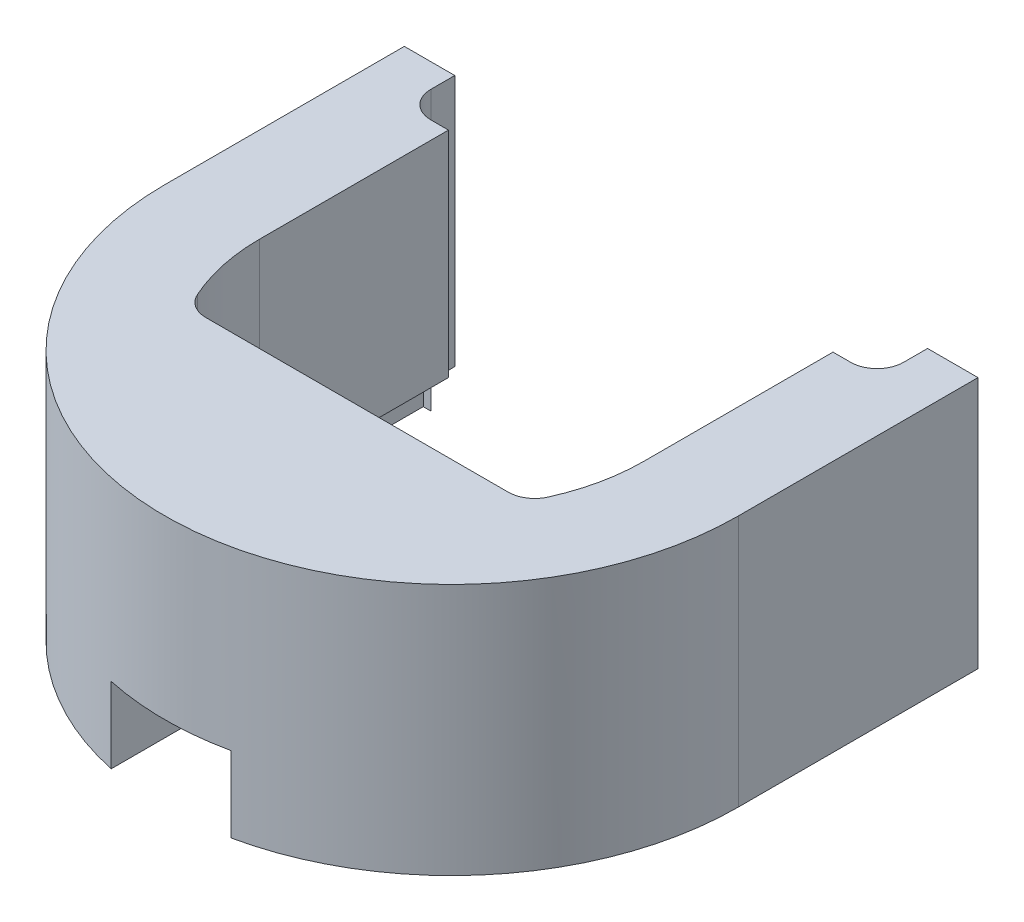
ISO-10303-21;
HEADER;
FILE_DESCRIPTION(('STEP AP214'),'2;1');
FILE_NAME('part.step','',(''),(''),'','','');
FILE_SCHEMA(('AUTOMOTIVE_DESIGN { 1 0 10303 214 1 1 1 1 }'));
ENDSEC;
DATA;
#1=APPLICATION_CONTEXT('core data for automotive mechanical design processes');
#2=APPLICATION_PROTOCOL_DEFINITION('international standard','automotive_design',2000,#1);
#3=PRODUCT_CONTEXT('',#1,'mechanical');
#4=PRODUCT('Part','Part','',(#3));
#5=PRODUCT_RELATED_PRODUCT_CATEGORY('part','',(#4));
#6=PRODUCT_DEFINITION_FORMATION('','',#4);
#7=PRODUCT_DEFINITION_CONTEXT('part definition',#1,'design');
#8=PRODUCT_DEFINITION('design','',#6,#7);
#9=PRODUCT_DEFINITION_SHAPE('','',#8);
#10=(LENGTH_UNIT() NAMED_UNIT(*) SI_UNIT(.MILLI.,.METRE.));
#11=(NAMED_UNIT(*) PLANE_ANGLE_UNIT() SI_UNIT($,.RADIAN.));
#12=(NAMED_UNIT(*) SI_UNIT($,.STERADIAN.) SOLID_ANGLE_UNIT());
#13=UNCERTAINTY_MEASURE_WITH_UNIT(LENGTH_MEASURE(1.E-05),#10,'distance_accuracy_value','');
#14=(GEOMETRIC_REPRESENTATION_CONTEXT(3) GLOBAL_UNCERTAINTY_ASSIGNED_CONTEXT((#13)) GLOBAL_UNIT_ASSIGNED_CONTEXT((#10,
#11,#12)) REPRESENTATION_CONTEXT('',''));
#15=CARTESIAN_POINT('',(0.,0.,0.));
#16=DIRECTION('',(0.,0.,1.));
#17=DIRECTION('',(1.,0.,0.));
#18=AXIS2_PLACEMENT_3D('',#15,#16,#17);
#19=CARTESIAN_POINT('',(23.9802001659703,0.,40.8));
#20=DIRECTION('',(0.,1.,0.));
#21=DIRECTION('',(0.,0.,1.));
#22=AXIS2_PLACEMENT_3D('',#19,#20,#21);
#23=PLANE('',#22);
#24=DIRECTION('',(-1.,0.,0.));
#25=VECTOR('',#24,1.);
#26=CARTESIAN_POINT('',(-18.7523331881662,0.,58.));
#27=LINE('',#26,#25);
#28=CARTESIAN_POINT('',(-9.5,0.,58.));
#29=VERTEX_POINT('',#28);
#30=CARTESIAN_POINT('',(-18.7523331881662,0.,58.));
#31=VERTEX_POINT('',#30);
#32=EDGE_CURVE('E347',#29,#31,#27,.T.);
#33=ORIENTED_EDGE('',*,*,#32,.F.);
#34=DIRECTION('',(0.,0.,-1.));
#35=VECTOR('',#34,1.);
#36=CARTESIAN_POINT('',(-9.5,0.,77.));
#37=LINE('',#36,#35);
#38=CARTESIAN_POINT('',(-9.5,0.,74.497190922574));
#39=VERTEX_POINT('',#38);
#40=EDGE_CURVE('E522',#39,#29,#37,.T.);
#41=ORIENTED_EDGE('',*,*,#40,.F.);
#42=CARTESIAN_POINT('',(0.,0.,30.));
#43=DIRECTION('',(0.,1.,0.));
#44=DIRECTION('',(0.,0.,1.));
#45=AXIS2_PLACEMENT_3D('',#42,#43,#44);
#46=CIRCLE('',#45,45.5);
#47=CARTESIAN_POINT('',(-45.5,0.,30.));
#48=VERTEX_POINT('',#47);
#49=EDGE_CURVE('E193',#48,#39,#46,.T.);
#50=ORIENTED_EDGE('',*,*,#49,.F.);
#51=DIRECTION('',(0.,0.,1.));
#52=VECTOR('',#51,1.);
#53=CARTESIAN_POINT('',(-45.5,0.,-8.));
#54=LINE('',#53,#52);
#55=CARTESIAN_POINT('',(-45.5,0.,-8.));
#56=VERTEX_POINT('',#55);
#57=EDGE_CURVE('E190',#56,#48,#54,.T.);
#58=ORIENTED_EDGE('',*,*,#57,.F.);
#59=DIRECTION('',(-1.,0.,0.));
#60=VECTOR('',#59,1.);
#61=CARTESIAN_POINT('',(-37.5,0.,-8.));
#62=LINE('',#61,#60);
#63=CARTESIAN_POINT('',(-37.5,0.,-8.));
#64=VERTEX_POINT('',#63);
#65=EDGE_CURVE('E188',#64,#56,#62,.T.);
#66=ORIENTED_EDGE('',*,*,#65,.F.);
#67=DIRECTION('',(0.,0.,-1.));
#68=VECTOR('',#67,1.);
#69=CARTESIAN_POINT('',(-37.5,0.,-4.20000000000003));
#70=LINE('',#69,#68);
#71=CARTESIAN_POINT('',(-37.5,0.,-4.20000000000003));
#72=VERTEX_POINT('',#71);
#73=EDGE_CURVE('E185',#72,#64,#70,.T.);
#74=ORIENTED_EDGE('',*,*,#73,.F.);
#75=CARTESIAN_POINT('',(-33.3,0.,-4.2));
#76=DIRECTION('',(0.,-1.,0.));
#77=DIRECTION('',(0.,0.,1.));
#78=AXIS2_PLACEMENT_3D('',#75,#76,#77);
#79=CIRCLE('',#78,4.2);
#80=CARTESIAN_POINT('',(-33.3,0.,0.));
#81=VERTEX_POINT('',#80);
#82=EDGE_CURVE('E183',#81,#72,#79,.T.);
#83=ORIENTED_EDGE('',*,*,#82,.F.);
#84=DIRECTION('',(1.,0.,0.));
#85=VECTOR('',#84,1.);
#86=CARTESIAN_POINT('',(-30.5,0.,0.));
#87=LINE('',#86,#85);
#88=CARTESIAN_POINT('',(-34.5,0.,0.));
#89=VERTEX_POINT('',#88);
#90=EDGE_CURVE('E360',#89,#81,#87,.T.);
#91=ORIENTED_EDGE('',*,*,#90,.F.);
#92=DIRECTION('',(0.,0.,-1.));
#93=VECTOR('',#92,1.);
#94=CARTESIAN_POINT('',(-34.5,0.,0.));
#95=LINE('',#94,#93);
#96=CARTESIAN_POINT('',(-34.5,0.,30.));
#97=VERTEX_POINT('',#96);
#98=EDGE_CURVE('E357',#97,#89,#95,.T.);
#99=ORIENTED_EDGE('',*,*,#98,.F.);
#100=CARTESIAN_POINT('',(0.,0.,30.));
#101=DIRECTION('',(0.,-1.,0.));
#102=DIRECTION('',(0.,0.,-1.));
#103=AXIS2_PLACEMENT_3D('',#100,#101,#102);
#104=CIRCLE('',#103,34.5);
#105=CARTESIAN_POINT('',(-21.3516665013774,0.,57.0990099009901));
#106=VERTEX_POINT('',#105);
#107=EDGE_CURVE('E354',#106,#97,#104,.T.);
#108=ORIENTED_EDGE('',*,*,#107,.F.);
#109=CARTESIAN_POINT('',(-18.7523331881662,0.,53.8));
#110=DIRECTION('',(0.,-1.,0.));
#111=DIRECTION('',(0.,0.,-1.));
#112=AXIS2_PLACEMENT_3D('',#109,#110,#111);
#113=CIRCLE('',#112,4.2);
#114=EDGE_CURVE('E351',#31,#106,#113,.T.);
#115=ORIENTED_EDGE('',*,*,#114,.F.);
#116=EDGE_LOOP('',(#33,#41,#50,#58,#66,#74,#83,#91,#99,#108,#115));
#117=FACE_BOUND('',#116,.T.);
#118=ADVANCED_FACE('F37',(#117),#23,.F.);
#119=CARTESIAN_POINT('',(-18.7523331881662,6.,58.));
#120=DIRECTION('',(0.,0.,1.));
#121=DIRECTION('',(1.,0.,0.));
#122=AXIS2_PLACEMENT_3D('',#119,#120,#121);
#123=PLANE('',#122);
#124=DIRECTION('',(-1.,0.,0.));
#125=VECTOR('',#124,1.);
#126=CARTESIAN_POINT('',(-18.7523331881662,6.,58.));
#127=LINE('',#126,#125);
#128=CARTESIAN_POINT('',(-9.5,6.,58.));
#129=VERTEX_POINT('',#128);
#130=CARTESIAN_POINT('',(-18.7523331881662,6.,58.));
#131=VERTEX_POINT('',#130);
#132=EDGE_CURVE('E316',#129,#131,#127,.T.);
#133=ORIENTED_EDGE('',*,*,#132,.F.);
#134=DIRECTION('',(0.,-1.,0.));
#135=VECTOR('',#134,1.);
#136=CARTESIAN_POINT('',(-9.5,6.,58.));
#137=LINE('',#136,#135);
#138=EDGE_CURVE('E269',#129,#29,#137,.T.);
#139=ORIENTED_EDGE('',*,*,#138,.T.);
#140=ORIENTED_EDGE('',*,*,#32,.T.);
#141=DIRECTION('',(0.,-1.,0.));
#142=VECTOR('',#141,1.);
#143=CARTESIAN_POINT('',(-18.7523331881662,6.,58.));
#144=LINE('',#143,#142);
#145=EDGE_CURVE('E373',#131,#31,#144,.T.);
#146=ORIENTED_EDGE('',*,*,#145,.F.);
#147=EDGE_LOOP('',(#133,#139,#140,#146));
#148=FACE_BOUND('',#147,.T.);
#149=ADVANCED_FACE('F578',(#148),#123,.F.);
#150=CARTESIAN_POINT('',(0.,6.,30.));
#151=DIRECTION('',(0.,-1.,0.));
#152=DIRECTION('',(0.,0.,-1.));
#153=AXIS2_PLACEMENT_3D('',#150,#151,#152);
#154=PLANE('',#153);
#155=DIRECTION('',(0.,0.,-1.));
#156=VECTOR('',#155,1.);
#157=CARTESIAN_POINT('',(-9.5,6.,30.));
#158=LINE('',#157,#156);
#159=CARTESIAN_POINT('',(-9.5,6.,45.));
#160=VERTEX_POINT('',#159);
#161=EDGE_CURVE('E45',#129,#160,#158,.T.);
#162=ORIENTED_EDGE('',*,*,#161,.F.);
#163=ORIENTED_EDGE('',*,*,#132,.T.);
#164=CARTESIAN_POINT('',(-18.7523331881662,6.,53.8));
#165=DIRECTION('',(0.,-1.,0.));
#166=DIRECTION('',(0.,0.,-1.));
#167=AXIS2_PLACEMENT_3D('',#164,#165,#166);
#168=CIRCLE('',#167,4.2);
#169=CARTESIAN_POINT('',(-21.3516665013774,6.,57.0990099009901));
#170=VERTEX_POINT('',#169);
#171=EDGE_CURVE('E320',#131,#170,#168,.T.);
#172=ORIENTED_EDGE('',*,*,#171,.T.);
#173=CARTESIAN_POINT('',(0.,6.,30.));
#174=DIRECTION('',(0.,-1.,0.));
#175=DIRECTION('',(0.,0.,-1.));
#176=AXIS2_PLACEMENT_3D('',#173,#174,#175);
#177=CIRCLE('',#176,34.5);
#178=CARTESIAN_POINT('',(-34.5,6.,30.));
#179=VERTEX_POINT('',#178);
#180=EDGE_CURVE('E323',#170,#179,#177,.T.);
#181=ORIENTED_EDGE('',*,*,#180,.T.);
#182=DIRECTION('',(0.,0.,-1.));
#183=VECTOR('',#182,1.);
#184=CARTESIAN_POINT('',(-34.5,6.,0.));
#185=LINE('',#184,#183);
#186=CARTESIAN_POINT('',(-34.5,6.,0.));
#187=VERTEX_POINT('',#186);
#188=EDGE_CURVE('E326',#179,#187,#185,.T.);
#189=ORIENTED_EDGE('',*,*,#188,.T.);
#190=DIRECTION('',(1.,0.,0.));
#191=VECTOR('',#190,1.);
#192=CARTESIAN_POINT('',(-30.5,6.,0.));
#193=LINE('',#192,#191);
#194=CARTESIAN_POINT('',(-33.3,6.,0.));
#195=VERTEX_POINT('',#194);
#196=EDGE_CURVE('E330',#187,#195,#193,.T.);
#197=ORIENTED_EDGE('',*,*,#196,.T.);
#198=CARTESIAN_POINT('',(-30.5,6.,0.));
#199=VERTEX_POINT('',#198);
#200=EDGE_CURVE('E329',#195,#199,#193,.T.);
#201=ORIENTED_EDGE('',*,*,#200,.T.);
#202=DIRECTION('',(0.,0.,1.));
#203=VECTOR('',#202,1.);
#204=CARTESIAN_POINT('',(-30.5,6.,30.));
#205=LINE('',#204,#203);
#206=CARTESIAN_POINT('',(-30.5,6.,30.));
#207=VERTEX_POINT('',#206);
#208=EDGE_CURVE('E333',#199,#207,#205,.T.);
#209=ORIENTED_EDGE('',*,*,#208,.T.);
#210=CARTESIAN_POINT('',(0.,6.,30.));
#211=DIRECTION('',(0.,1.,0.));
#212=DIRECTION('',(0.,0.,-1.));
#213=AXIS2_PLACEMENT_3D('',#210,#211,#212);
#214=CIRCLE('',#213,30.5);
#215=CARTESIAN_POINT('',(-27.8097378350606,6.,42.5247148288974));
#216=VERTEX_POINT('',#215);
#217=EDGE_CURVE('E363',#207,#216,#214,.T.);
#218=ORIENTED_EDGE('',*,*,#217,.T.);
#219=CARTESIAN_POINT('',(-23.9802001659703,6.,40.8));
#220=DIRECTION('',(0.,1.,0.));
#221=DIRECTION('',(0.,0.,1.));
#222=AXIS2_PLACEMENT_3D('',#219,#220,#221);
#223=CIRCLE('',#222,4.2);
#224=CARTESIAN_POINT('',(-23.9802001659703,6.,45.));
#225=VERTEX_POINT('',#224);
#226=EDGE_CURVE('E289',#216,#225,#223,.T.);
#227=ORIENTED_EDGE('',*,*,#226,.T.);
#228=DIRECTION('',(1.,0.,0.));
#229=VECTOR('',#228,1.);
#230=CARTESIAN_POINT('',(-23.9802001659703,6.,45.));
#231=LINE('',#230,#229);
#232=EDGE_CURVE('E280',#225,#160,#231,.T.);
#233=ORIENTED_EDGE('',*,*,#232,.T.);
#234=EDGE_LOOP('',(#162,#163,#172,#181,#189,#197,#201,#209,#218,#227,#233));
#235=FACE_BOUND('',#234,.T.);
#236=CARTESIAN_POINT('',(-18.,6.,51.));
#237=DIRECTION('',(0.,-1.,0.));
#238=DIRECTION('',(0.,0.,1.));
#239=AXIS2_PLACEMENT_3D('',#236,#237,#238);
#240=CIRCLE('',#239,3.);
#241=CARTESIAN_POINT('',(-18.,6.,54.));
#242=VERTEX_POINT('',#241);
#243=EDGE_CURVE('E529',#242,#242,#240,.T.);
#244=ORIENTED_EDGE('',*,*,#243,.F.);
#245=EDGE_LOOP('',(#244));
#246=FACE_BOUND('',#245,.T.);
#247=ADVANCED_FACE('F285',(#235,#246),#154,.T.);
#248=CARTESIAN_POINT('',(23.9802001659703,40.,40.8));
#249=DIRECTION('',(0.,-1.,0.));
#250=DIRECTION('',(0.,0.,-1.));
#251=AXIS2_PLACEMENT_3D('',#248,#249,#250);
#252=CYLINDRICAL_SURFACE('',#251,4.2);
#253=CARTESIAN_POINT('',(23.9802001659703,6.,40.8));
#254=DIRECTION('',(0.,1.,0.));
#255=DIRECTION('',(0.,0.,1.));
#256=AXIS2_PLACEMENT_3D('',#253,#254,#255);
#257=CIRCLE('',#256,4.2);
#258=CARTESIAN_POINT('',(23.9802001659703,6.,45.));
#259=VERTEX_POINT('',#258);
#260=CARTESIAN_POINT('',(27.8097378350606,6.,42.5247148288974));
#261=VERTEX_POINT('',#260);
#262=EDGE_CURVE('E290',#259,#261,#257,.T.);
#263=ORIENTED_EDGE('',*,*,#262,.F.);
#264=DIRECTION('',(0.,-1.,0.));
#265=VECTOR('',#264,1.);
#266=CARTESIAN_POINT('',(23.9802001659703,40.,45.));
#267=LINE('',#266,#265);
#268=CARTESIAN_POINT('',(23.9802001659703,40.,45.));
#269=VERTEX_POINT('',#268);
#270=EDGE_CURVE('E249',#269,#259,#267,.T.);
#271=ORIENTED_EDGE('',*,*,#270,.F.);
#272=CARTESIAN_POINT('',(23.9802001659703,40.,40.8));
#273=DIRECTION('',(0.,-1.,0.));
#274=DIRECTION('',(0.,0.,1.));
#275=AXIS2_PLACEMENT_3D('',#272,#273,#274);
#276=CIRCLE('',#275,4.2);
#277=CARTESIAN_POINT('',(27.8097378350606,40.,42.5247148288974));
#278=VERTEX_POINT('',#277);
#279=EDGE_CURVE('E205',#278,#269,#276,.T.);
#280=ORIENTED_EDGE('',*,*,#279,.F.);
#281=DIRECTION('',(0.,-1.,0.));
#282=VECTOR('',#281,1.);
#283=CARTESIAN_POINT('',(27.8097378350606,40.,42.5247148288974));
#284=LINE('',#283,#282);
#285=EDGE_CURVE('E179',#278,#261,#284,.T.);
#286=ORIENTED_EDGE('',*,*,#285,.T.);
#287=EDGE_LOOP('',(#263,#271,#280,#286));
#288=FACE_BOUND('',#287,.T.);
#289=ADVANCED_FACE('F39',(#288),#252,.F.);
#290=CARTESIAN_POINT('',(-23.9802001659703,40.,45.));
#291=DIRECTION('',(0.,0.,1.));
#292=DIRECTION('',(1.,0.,0.));
#293=AXIS2_PLACEMENT_3D('',#290,#291,#292);
#294=PLANE('',#293);
#295=DIRECTION('',(1.,0.,0.));
#296=VECTOR('',#295,1.);
#297=CARTESIAN_POINT('',(-9.5,12.,45.));
#298=LINE('',#297,#296);
#299=CARTESIAN_POINT('',(-9.5,12.,45.));
#300=VERTEX_POINT('',#299);
#301=CARTESIAN_POINT('',(9.5,12.,45.));
#302=VERTEX_POINT('',#301);
#303=EDGE_CURVE('E282',#300,#302,#298,.T.);
#304=ORIENTED_EDGE('',*,*,#303,.F.);
#305=DIRECTION('',(0.,1.,0.));
#306=VECTOR('',#305,1.);
#307=CARTESIAN_POINT('',(-9.5,12.,45.));
#308=LINE('',#307,#306);
#309=EDGE_CURVE('E265',#160,#300,#308,.T.);
#310=ORIENTED_EDGE('',*,*,#309,.F.);
#311=ORIENTED_EDGE('',*,*,#232,.F.);
#312=DIRECTION('',(0.,-1.,0.));
#313=VECTOR('',#312,1.);
#314=CARTESIAN_POINT('',(-23.9802001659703,40.,45.));
#315=LINE('',#314,#313);
#316=CARTESIAN_POINT('',(-23.9802001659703,40.,45.));
#317=VERTEX_POINT('',#316);
#318=EDGE_CURVE('E246',#317,#225,#315,.T.);
#319=ORIENTED_EDGE('',*,*,#318,.F.);
#320=DIRECTION('',(-1.,0.,0.));
#321=VECTOR('',#320,1.);
#322=CARTESIAN_POINT('',(-23.9802001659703,40.,45.));
#323=LINE('',#322,#321);
#324=EDGE_CURVE('E107',#269,#317,#323,.T.);
#325=ORIENTED_EDGE('',*,*,#324,.F.);
#326=ORIENTED_EDGE('',*,*,#270,.T.);
#327=CARTESIAN_POINT('',(9.5,6.,45.));
#328=VERTEX_POINT('',#327);
#329=EDGE_CURVE('E291',#328,#259,#231,.T.);
#330=ORIENTED_EDGE('',*,*,#329,.F.);
#331=DIRECTION('',(0.,-1.,0.));
#332=VECTOR('',#331,1.);
#333=CARTESIAN_POINT('',(9.5,12.,45.));
#334=LINE('',#333,#332);
#335=EDGE_CURVE('E52',#302,#328,#334,.T.);
#336=ORIENTED_EDGE('',*,*,#335,.F.);
#337=EDGE_LOOP('',(#304,#310,#311,#319,#325,#326,#330,#336));
#338=FACE_BOUND('',#337,.T.);
#339=ADVANCED_FACE('F278',(#338),#294,.F.);
#340=CARTESIAN_POINT('',(-23.9802001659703,40.,40.8));
#341=DIRECTION('',(0.,-1.,0.));
#342=DIRECTION('',(0.,0.,-1.));
#343=AXIS2_PLACEMENT_3D('',#340,#341,#342);
#344=CYLINDRICAL_SURFACE('',#343,4.2);
#345=ORIENTED_EDGE('',*,*,#226,.F.);
#346=DIRECTION('',(0.,-1.,0.));
#347=VECTOR('',#346,1.);
#348=CARTESIAN_POINT('',(-27.8097378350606,40.,42.5247148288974));
#349=LINE('',#348,#347);
#350=CARTESIAN_POINT('',(-27.8097378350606,40.,42.5247148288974));
#351=VERTEX_POINT('',#350);
#352=EDGE_CURVE('E243',#351,#216,#349,.T.);
#353=ORIENTED_EDGE('',*,*,#352,.F.);
#354=CARTESIAN_POINT('',(-23.9802001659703,40.,40.8));
#355=DIRECTION('',(0.,-1.,0.));
#356=DIRECTION('',(0.,0.,-1.));
#357=AXIS2_PLACEMENT_3D('',#354,#355,#356);
#358=CIRCLE('',#357,4.2);
#359=EDGE_CURVE('E392',#317,#351,#358,.T.);
#360=ORIENTED_EDGE('',*,*,#359,.F.);
#361=ORIENTED_EDGE('',*,*,#318,.T.);
#362=EDGE_LOOP('',(#345,#353,#360,#361));
#363=FACE_BOUND('',#362,.T.);
#364=ADVANCED_FACE('F544',(#363),#344,.F.);
#365=CARTESIAN_POINT('',(0.,40.,30.));
#366=DIRECTION('',(0.,-1.,0.));
#367=DIRECTION('',(0.,0.,-1.));
#368=AXIS2_PLACEMENT_3D('',#365,#366,#367);
#369=CYLINDRICAL_SURFACE('',#368,30.5);
#370=ORIENTED_EDGE('',*,*,#217,.F.);
#371=DIRECTION('',(0.,-1.,0.));
#372=VECTOR('',#371,1.);
#373=CARTESIAN_POINT('',(-30.5,40.,30.));
#374=LINE('',#373,#372);
#375=CARTESIAN_POINT('',(-30.5,40.,30.));
#376=VERTEX_POINT('',#375);
#377=EDGE_CURVE('E240',#376,#207,#374,.T.);
#378=ORIENTED_EDGE('',*,*,#377,.F.);
#379=CARTESIAN_POINT('',(0.,40.,30.));
#380=DIRECTION('',(0.,-1.,0.));
#381=DIRECTION('',(0.,0.,1.));
#382=AXIS2_PLACEMENT_3D('',#379,#380,#381);
#383=CIRCLE('',#382,30.5);
#384=EDGE_CURVE('E394',#351,#376,#383,.T.);
#385=ORIENTED_EDGE('',*,*,#384,.F.);
#386=ORIENTED_EDGE('',*,*,#352,.T.);
#387=EDGE_LOOP('',(#370,#378,#385,#386));
#388=FACE_BOUND('',#387,.T.);
#389=ADVANCED_FACE('F547',(#388),#369,.F.);
#390=CARTESIAN_POINT('',(-30.5,40.,30.));
#391=DIRECTION('',(-1.,0.,0.));
#392=DIRECTION('',(0.,0.,1.));
#393=AXIS2_PLACEMENT_3D('',#390,#391,#392);
#394=PLANE('',#393);
#395=ORIENTED_EDGE('',*,*,#208,.F.);
#396=DIRECTION('',(0.,-1.,0.));
#397=VECTOR('',#396,1.);
#398=CARTESIAN_POINT('',(-30.5,40.,0.));
#399=LINE('',#398,#397);
#400=CARTESIAN_POINT('',(-30.5,40.,0.));
#401=VERTEX_POINT('',#400);
#402=EDGE_CURVE('E237',#401,#199,#399,.T.);
#403=ORIENTED_EDGE('',*,*,#402,.F.);
#404=DIRECTION('',(0.,0.,-1.));
#405=VECTOR('',#404,1.);
#406=CARTESIAN_POINT('',(-30.5,40.,30.));
#407=LINE('',#406,#405);
#408=EDGE_CURVE('E396',#376,#401,#407,.T.);
#409=ORIENTED_EDGE('',*,*,#408,.F.);
#410=ORIENTED_EDGE('',*,*,#377,.T.);
#411=EDGE_LOOP('',(#395,#403,#409,#410));
#412=FACE_BOUND('',#411,.T.);
#413=ADVANCED_FACE('F874',(#412),#394,.F.);
#414=CARTESIAN_POINT('',(-30.5,40.,0.));
#415=DIRECTION('',(0.,0.,1.));
#416=DIRECTION('',(1.,0.,0.));
#417=AXIS2_PLACEMENT_3D('',#414,#415,#416);
#418=PLANE('',#417);
#419=ORIENTED_EDGE('',*,*,#200,.F.);
#420=DIRECTION('',(0.,-1.,0.));
#421=VECTOR('',#420,1.);
#422=CARTESIAN_POINT('',(-33.3,40.,0.));
#423=LINE('',#422,#421);
#424=CARTESIAN_POINT('',(-33.3,40.,0.));
#425=VERTEX_POINT('',#424);
#426=EDGE_CURVE('E234',#425,#195,#423,.T.);
#427=ORIENTED_EDGE('',*,*,#426,.F.);
#428=DIRECTION('',(-1.,0.,0.));
#429=VECTOR('',#428,1.);
#430=CARTESIAN_POINT('',(-30.5,40.,0.));
#431=LINE('',#430,#429);
#432=EDGE_CURVE('E398',#401,#425,#431,.T.);
#433=ORIENTED_EDGE('',*,*,#432,.F.);
#434=ORIENTED_EDGE('',*,*,#402,.T.);
#435=EDGE_LOOP('',(#419,#427,#433,#434));
#436=FACE_BOUND('',#435,.T.);
#437=ADVANCED_FACE('F600',(#436),#418,.F.);
#438=CARTESIAN_POINT('',(30.5,40.,0.));
#439=DIRECTION('',(0.,0.,1.));
#440=DIRECTION('',(1.,0.,0.));
#441=AXIS2_PLACEMENT_3D('',#438,#439,#440);
#442=PLANE('',#441);
#443=DIRECTION('',(1.,0.,0.));
#444=VECTOR('',#443,1.);
#445=CARTESIAN_POINT('',(30.5,6.,0.));
#446=LINE('',#445,#444);
#447=CARTESIAN_POINT('',(30.5,6.,0.));
#448=VERTEX_POINT('',#447);
#449=CARTESIAN_POINT('',(33.3,6.,0.));
#450=VERTEX_POINT('',#449);
#451=EDGE_CURVE('E170',#448,#450,#446,.T.);
#452=ORIENTED_EDGE('',*,*,#451,.F.);
#453=DIRECTION('',(0.,-1.,0.));
#454=VECTOR('',#453,1.);
#455=CARTESIAN_POINT('',(30.5,40.,0.));
#456=LINE('',#455,#454);
#457=CARTESIAN_POINT('',(30.5,40.,0.));
#458=VERTEX_POINT('',#457);
#459=EDGE_CURVE('E166',#458,#448,#456,.T.);
#460=ORIENTED_EDGE('',*,*,#459,.F.);
#461=DIRECTION('',(-1.,0.,0.));
#462=VECTOR('',#461,1.);
#463=CARTESIAN_POINT('',(30.5,40.,0.));
#464=LINE('',#463,#462);
#465=CARTESIAN_POINT('',(33.3,40.,0.));
#466=VERTEX_POINT('',#465);
#467=EDGE_CURVE('E152',#466,#458,#464,.T.);
#468=ORIENTED_EDGE('',*,*,#467,.F.);
#469=DIRECTION('',(0.,-1.,0.));
#470=VECTOR('',#469,1.);
#471=CARTESIAN_POINT('',(33.3,40.,0.));
#472=LINE('',#471,#470);
#473=EDGE_CURVE('E173',#466,#450,#472,.T.);
#474=ORIENTED_EDGE('',*,*,#473,.T.);
#475=EDGE_LOOP('',(#452,#460,#468,#474));
#476=FACE_BOUND('',#475,.T.);
#477=ADVANCED_FACE('F167',(#476),#442,.F.);
#478=CARTESIAN_POINT('',(30.5,40.,30.));
#479=DIRECTION('',(1.,0.,0.));
#480=DIRECTION('',(0.,0.,-1.));
#481=AXIS2_PLACEMENT_3D('',#478,#479,#480);
#482=PLANE('',#481);
#483=DIRECTION('',(0.,0.,-1.));
#484=VECTOR('',#483,1.);
#485=CARTESIAN_POINT('',(30.5,6.,30.));
#486=LINE('',#485,#484);
#487=CARTESIAN_POINT('',(30.5,6.,30.));
#488=VERTEX_POINT('',#487);
#489=EDGE_CURVE('E302',#488,#448,#486,.T.);
#490=ORIENTED_EDGE('',*,*,#489,.F.);
#491=DIRECTION('',(0.,-1.,0.));
#492=VECTOR('',#491,1.);
#493=CARTESIAN_POINT('',(30.5,40.,30.));
#494=LINE('',#493,#492);
#495=CARTESIAN_POINT('',(30.5,40.,30.));
#496=VERTEX_POINT('',#495);
#497=EDGE_CURVE('E174',#496,#488,#494,.T.);
#498=ORIENTED_EDGE('',*,*,#497,.F.);
#499=DIRECTION('',(0.,0.,1.));
#500=VECTOR('',#499,1.);
#501=CARTESIAN_POINT('',(30.5,40.,30.));
#502=LINE('',#501,#500);
#503=EDGE_CURVE('E156',#458,#496,#502,.T.);
#504=ORIENTED_EDGE('',*,*,#503,.F.);
#505=ORIENTED_EDGE('',*,*,#459,.T.);
#506=EDGE_LOOP('',(#490,#498,#504,#505));
#507=FACE_BOUND('',#506,.T.);
#508=ADVANCED_FACE('F176',(#507),#482,.F.);
#509=CARTESIAN_POINT('',(0.,40.,30.));
#510=DIRECTION('',(0.,-1.,0.));
#511=DIRECTION('',(0.,0.,-1.));
#512=AXIS2_PLACEMENT_3D('',#509,#510,#511);
#513=CYLINDRICAL_SURFACE('',#512,30.5);
#514=CARTESIAN_POINT('',(0.,6.,30.));
#515=DIRECTION('',(0.,1.,0.));
#516=DIRECTION('',(0.,0.,-1.));
#517=AXIS2_PLACEMENT_3D('',#514,#515,#516);
#518=CIRCLE('',#517,30.5);
#519=EDGE_CURVE('E294',#261,#488,#518,.T.);
#520=ORIENTED_EDGE('',*,*,#519,.F.);
#521=ORIENTED_EDGE('',*,*,#285,.F.);
#522=CARTESIAN_POINT('',(0.,40.,30.));
#523=DIRECTION('',(0.,-1.,0.));
#524=DIRECTION('',(0.,0.,1.));
#525=AXIS2_PLACEMENT_3D('',#522,#523,#524);
#526=CIRCLE('',#525,30.5);
#527=EDGE_CURVE('E61',#496,#278,#526,.T.);
#528=ORIENTED_EDGE('',*,*,#527,.F.);
#529=ORIENTED_EDGE('',*,*,#497,.T.);
#530=EDGE_LOOP('',(#520,#521,#528,#529));
#531=FACE_BOUND('',#530,.T.);
#532=ADVANCED_FACE('F640',(#531),#513,.F.);
#533=CARTESIAN_POINT('',(-33.3,40.,-4.2));
#534=DIRECTION('',(0.,-1.,0.));
#535=DIRECTION('',(0.,0.,-1.));
#536=AXIS2_PLACEMENT_3D('',#533,#534,#535);
#537=CYLINDRICAL_SURFACE('',#536,4.2);
#538=ORIENTED_EDGE('',*,*,#82,.T.);
#539=DIRECTION('',(0.,-1.,0.));
#540=VECTOR('',#539,1.);
#541=CARTESIAN_POINT('',(-37.5,40.,-4.20000000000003));
#542=LINE('',#541,#540);
#543=CARTESIAN_POINT('',(-37.5,40.,-4.20000000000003));
#544=VERTEX_POINT('',#543);
#545=EDGE_CURVE('E231',#544,#72,#542,.T.);
#546=ORIENTED_EDGE('',*,*,#545,.F.);
#547=CARTESIAN_POINT('',(-33.3,40.,-4.2));
#548=DIRECTION('',(0.,-1.,0.));
#549=DIRECTION('',(0.,0.,1.));
#550=AXIS2_PLACEMENT_3D('',#547,#548,#549);
#551=CIRCLE('',#550,4.2);
#552=EDGE_CURVE('E400',#425,#544,#551,.T.);
#553=ORIENTED_EDGE('',*,*,#552,.F.);
#554=ORIENTED_EDGE('',*,*,#426,.T.);
#555=DIRECTION('',(0.,-1.,0.));
#556=VECTOR('',#555,1.);
#557=CARTESIAN_POINT('',(-33.3,40.,0.));
#558=LINE('',#557,#556);
#559=EDGE_CURVE('E186',#81,#195,#558,.F.);
#560=ORIENTED_EDGE('',*,*,#559,.F.);
#561=EDGE_LOOP('',(#538,#546,#553,#554,#560));
#562=FACE_BOUND('',#561,.T.);
#563=ADVANCED_FACE('F604',(#562),#537,.F.);
#564=CARTESIAN_POINT('',(-37.5,40.,-4.20000000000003));
#565=DIRECTION('',(-1.,0.,0.));
#566=DIRECTION('',(0.,0.,1.));
#567=AXIS2_PLACEMENT_3D('',#564,#565,#566);
#568=PLANE('',#567);
#569=ORIENTED_EDGE('',*,*,#73,.T.);
#570=DIRECTION('',(0.,-1.,0.));
#571=VECTOR('',#570,1.);
#572=CARTESIAN_POINT('',(-37.5,40.,-8.));
#573=LINE('',#572,#571);
#574=CARTESIAN_POINT('',(-37.5,40.,-8.));
#575=VERTEX_POINT('',#574);
#576=EDGE_CURVE('E228',#575,#64,#573,.T.);
#577=ORIENTED_EDGE('',*,*,#576,.F.);
#578=DIRECTION('',(0.,0.,-1.));
#579=VECTOR('',#578,1.);
#580=CARTESIAN_POINT('',(-37.5,40.,-4.20000000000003));
#581=LINE('',#580,#579);
#582=EDGE_CURVE('E402',#544,#575,#581,.T.);
#583=ORIENTED_EDGE('',*,*,#582,.F.);
#584=ORIENTED_EDGE('',*,*,#545,.T.);
#585=EDGE_LOOP('',(#569,#577,#583,#584));
#586=FACE_BOUND('',#585,.T.);
#587=ADVANCED_FACE('F612',(#586),#568,.F.);
#588=CARTESIAN_POINT('',(-37.5,40.,-8.));
#589=DIRECTION('',(0.,0.,1.));
#590=DIRECTION('',(1.,0.,0.));
#591=AXIS2_PLACEMENT_3D('',#588,#589,#590);
#592=PLANE('',#591);
#593=ORIENTED_EDGE('',*,*,#65,.T.);
#594=DIRECTION('',(0.,-1.,0.));
#595=VECTOR('',#594,1.);
#596=CARTESIAN_POINT('',(-45.5,40.,-8.));
#597=LINE('',#596,#595);
#598=CARTESIAN_POINT('',(-45.5,40.,-8.));
#599=VERTEX_POINT('',#598);
#600=EDGE_CURVE('E225',#599,#56,#597,.T.);
#601=ORIENTED_EDGE('',*,*,#600,.F.);
#602=DIRECTION('',(-1.,0.,0.));
#603=VECTOR('',#602,1.);
#604=CARTESIAN_POINT('',(-37.5,40.,-8.));
#605=LINE('',#604,#603);
#606=EDGE_CURVE('E404',#575,#599,#605,.T.);
#607=ORIENTED_EDGE('',*,*,#606,.F.);
#608=ORIENTED_EDGE('',*,*,#576,.T.);
#609=EDGE_LOOP('',(#593,#601,#607,#608));
#610=FACE_BOUND('',#609,.T.);
#611=ADVANCED_FACE('F616',(#610),#592,.F.);
#612=CARTESIAN_POINT('',(-45.5,40.,-8.));
#613=DIRECTION('',(1.,0.,0.));
#614=DIRECTION('',(0.,0.,-1.));
#615=AXIS2_PLACEMENT_3D('',#612,#613,#614);
#616=PLANE('',#615);
#617=ORIENTED_EDGE('',*,*,#57,.T.);
#618=DIRECTION('',(0.,-1.,0.));
#619=VECTOR('',#618,1.);
#620=CARTESIAN_POINT('',(-45.5,40.,30.));
#621=LINE('',#620,#619);
#622=CARTESIAN_POINT('',(-45.5,40.,30.));
#623=VERTEX_POINT('',#622);
#624=EDGE_CURVE('E222',#623,#48,#621,.T.);
#625=ORIENTED_EDGE('',*,*,#624,.F.);
#626=DIRECTION('',(0.,0.,1.));
#627=VECTOR('',#626,1.);
#628=CARTESIAN_POINT('',(-45.5,40.,-8.));
#629=LINE('',#628,#627);
#630=EDGE_CURVE('E406',#599,#623,#629,.T.);
#631=ORIENTED_EDGE('',*,*,#630,.F.);
#632=ORIENTED_EDGE('',*,*,#600,.T.);
#633=EDGE_LOOP('',(#617,#625,#631,#632));
#634=FACE_BOUND('',#633,.T.);
#635=ADVANCED_FACE('F621',(#634),#616,.F.);
#636=CARTESIAN_POINT('',(0.,40.,30.));
#637=DIRECTION('',(0.,-1.,0.));
#638=DIRECTION('',(0.,0.,-1.));
#639=AXIS2_PLACEMENT_3D('',#636,#637,#638);
#640=CYLINDRICAL_SURFACE('',#639,45.5);
#641=ORIENTED_EDGE('',*,*,#49,.T.);
#642=DIRECTION('',(0.,-1.,0.));
#643=VECTOR('',#642,1.);
#644=CARTESIAN_POINT('',(-9.5,40.,74.497190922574));
#645=LINE('',#644,#643);
#646=CARTESIAN_POINT('',(-9.5,12.,74.497190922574));
#647=VERTEX_POINT('',#646);
#648=EDGE_CURVE('E526',#39,#647,#645,.F.);
#649=ORIENTED_EDGE('',*,*,#648,.T.);
#650=CARTESIAN_POINT('',(0.,12.,30.));
#651=DIRECTION('',(0.,1.,0.));
#652=DIRECTION('',(0.,0.,1.));
#653=AXIS2_PLACEMENT_3D('',#650,#651,#652);
#654=CIRCLE('',#653,45.5);
#655=CARTESIAN_POINT('',(9.5,12.,74.497190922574));
#656=VERTEX_POINT('',#655);
#657=EDGE_CURVE('E11',#647,#656,#654,.T.);
#658=ORIENTED_EDGE('',*,*,#657,.T.);
#659=DIRECTION('',(0.,-1.,0.));
#660=VECTOR('',#659,1.);
#661=CARTESIAN_POINT('',(9.5,40.,74.497190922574));
#662=LINE('',#661,#660);
#663=CARTESIAN_POINT('',(9.5,0.,74.497190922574));
#664=VERTEX_POINT('',#663);
#665=EDGE_CURVE('E521',#656,#664,#662,.T.);
#666=ORIENTED_EDGE('',*,*,#665,.T.);
#667=CARTESIAN_POINT('',(45.5,0.,30.));
#668=VERTEX_POINT('',#667);
#669=EDGE_CURVE('E192',#664,#668,#46,.T.);
#670=ORIENTED_EDGE('',*,*,#669,.T.);
#671=DIRECTION('',(0.,-1.,0.));
#672=VECTOR('',#671,1.);
#673=CARTESIAN_POINT('',(45.5,40.,30.));
#674=LINE('',#673,#672);
#675=CARTESIAN_POINT('',(45.5,40.,30.));
#676=VERTEX_POINT('',#675);
#677=EDGE_CURVE('E219',#676,#668,#674,.T.);
#678=ORIENTED_EDGE('',*,*,#677,.F.);
#679=CARTESIAN_POINT('',(0.,40.,30.));
#680=DIRECTION('',(0.,1.,0.));
#681=DIRECTION('',(0.,0.,1.));
#682=AXIS2_PLACEMENT_3D('',#679,#680,#681);
#683=CIRCLE('',#682,45.5);
#684=EDGE_CURVE('E408',#623,#676,#683,.T.);
#685=ORIENTED_EDGE('',*,*,#684,.F.);
#686=ORIENTED_EDGE('',*,*,#624,.T.);
#687=EDGE_LOOP('',(#641,#649,#658,#666,#670,#678,#685,#686));
#688=FACE_BOUND('',#687,.T.);
#689=ADVANCED_FACE('F627',(#688),#640,.T.);
#690=CARTESIAN_POINT('',(45.5,40.,-8.));
#691=DIRECTION('',(-1.,0.,0.));
#692=DIRECTION('',(0.,0.,1.));
#693=AXIS2_PLACEMENT_3D('',#690,#691,#692);
#694=PLANE('',#693);
#695=DIRECTION('',(0.,0.,-1.));
#696=VECTOR('',#695,1.);
#697=CARTESIAN_POINT('',(45.5,0.,-8.));
#698=LINE('',#697,#696);
#699=CARTESIAN_POINT('',(45.5,0.,-8.));
#700=VERTEX_POINT('',#699);
#701=EDGE_CURVE('E196',#668,#700,#698,.T.);
#702=ORIENTED_EDGE('',*,*,#701,.T.);
#703=DIRECTION('',(0.,-1.,0.));
#704=VECTOR('',#703,1.);
#705=CARTESIAN_POINT('',(45.5,40.,-8.));
#706=LINE('',#705,#704);
#707=CARTESIAN_POINT('',(45.5,40.,-8.));
#708=VERTEX_POINT('',#707);
#709=EDGE_CURVE('E216',#708,#700,#706,.T.);
#710=ORIENTED_EDGE('',*,*,#709,.F.);
#711=DIRECTION('',(0.,0.,-1.));
#712=VECTOR('',#711,1.);
#713=CARTESIAN_POINT('',(45.5,40.,-8.));
#714=LINE('',#713,#712);
#715=EDGE_CURVE('E410',#676,#708,#714,.T.);
#716=ORIENTED_EDGE('',*,*,#715,.F.);
#717=ORIENTED_EDGE('',*,*,#677,.T.);
#718=EDGE_LOOP('',(#702,#710,#716,#717));
#719=FACE_BOUND('',#718,.T.);
#720=ADVANCED_FACE('F629',(#719),#694,.F.);
#721=CARTESIAN_POINT('',(37.5,40.,-8.));
#722=DIRECTION('',(0.,0.,1.));
#723=DIRECTION('',(1.,0.,0.));
#724=AXIS2_PLACEMENT_3D('',#721,#722,#723);
#725=PLANE('',#724);
#726=DIRECTION('',(-1.,0.,0.));
#727=VECTOR('',#726,1.);
#728=CARTESIAN_POINT('',(37.5,0.,-8.));
#729=LINE('',#728,#727);
#730=CARTESIAN_POINT('',(37.5,0.,-8.));
#731=VERTEX_POINT('',#730);
#732=EDGE_CURVE('E198',#700,#731,#729,.T.);
#733=ORIENTED_EDGE('',*,*,#732,.T.);
#734=DIRECTION('',(0.,-1.,0.));
#735=VECTOR('',#734,1.);
#736=CARTESIAN_POINT('',(37.5,40.,-8.));
#737=LINE('',#736,#735);
#738=CARTESIAN_POINT('',(37.5,40.,-8.));
#739=VERTEX_POINT('',#738);
#740=EDGE_CURVE('E213',#739,#731,#737,.T.);
#741=ORIENTED_EDGE('',*,*,#740,.F.);
#742=DIRECTION('',(-1.,0.,0.));
#743=VECTOR('',#742,1.);
#744=CARTESIAN_POINT('',(37.5,40.,-8.));
#745=LINE('',#744,#743);
#746=EDGE_CURVE('E412',#708,#739,#745,.T.);
#747=ORIENTED_EDGE('',*,*,#746,.F.);
#748=ORIENTED_EDGE('',*,*,#709,.T.);
#749=EDGE_LOOP('',(#733,#741,#747,#748));
#750=FACE_BOUND('',#749,.T.);
#751=ADVANCED_FACE('F632',(#750),#725,.F.);
#752=CARTESIAN_POINT('',(37.5,40.,-4.20000000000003));
#753=DIRECTION('',(1.,0.,0.));
#754=DIRECTION('',(0.,0.,-1.));
#755=AXIS2_PLACEMENT_3D('',#752,#753,#754);
#756=PLANE('',#755);
#757=DIRECTION('',(0.,0.,1.));
#758=VECTOR('',#757,1.);
#759=CARTESIAN_POINT('',(37.5,0.,-4.20000000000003));
#760=LINE('',#759,#758);
#761=CARTESIAN_POINT('',(37.5,0.,-4.20000000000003));
#762=VERTEX_POINT('',#761);
#763=EDGE_CURVE('E200',#731,#762,#760,.T.);
#764=ORIENTED_EDGE('',*,*,#763,.T.);
#765=DIRECTION('',(0.,-1.,0.));
#766=VECTOR('',#765,1.);
#767=CARTESIAN_POINT('',(37.5,40.,-4.20000000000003));
#768=LINE('',#767,#766);
#769=CARTESIAN_POINT('',(37.5,40.,-4.20000000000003));
#770=VERTEX_POINT('',#769);
#771=EDGE_CURVE('E210',#770,#762,#768,.T.);
#772=ORIENTED_EDGE('',*,*,#771,.F.);
#773=DIRECTION('',(0.,0.,1.));
#774=VECTOR('',#773,1.);
#775=CARTESIAN_POINT('',(37.5,40.,-4.20000000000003));
#776=LINE('',#775,#774);
#777=EDGE_CURVE('E414',#739,#770,#776,.T.);
#778=ORIENTED_EDGE('',*,*,#777,.F.);
#779=ORIENTED_EDGE('',*,*,#740,.T.);
#780=EDGE_LOOP('',(#764,#772,#778,#779));
#781=FACE_BOUND('',#780,.T.);
#782=ADVANCED_FACE('F420',(#781),#756,.F.);
#783=CARTESIAN_POINT('',(33.3,40.,-4.2));
#784=DIRECTION('',(0.,-1.,0.));
#785=DIRECTION('',(0.,0.,-1.));
#786=AXIS2_PLACEMENT_3D('',#783,#784,#785);
#787=CYLINDRICAL_SURFACE('',#786,4.2);
#788=CARTESIAN_POINT('',(33.3,0.,-4.2));
#789=DIRECTION('',(0.,-1.,0.));
#790=DIRECTION('',(0.,0.,-1.));
#791=AXIS2_PLACEMENT_3D('',#788,#789,#790);
#792=CIRCLE('',#791,4.2);
#793=CARTESIAN_POINT('',(33.3,0.,0.));
#794=VERTEX_POINT('',#793);
#795=EDGE_CURVE('E202',#762,#794,#792,.T.);
#796=ORIENTED_EDGE('',*,*,#795,.T.);
#797=DIRECTION('',(0.,-1.,0.));
#798=VECTOR('',#797,1.);
#799=CARTESIAN_POINT('',(33.3,40.,0.));
#800=LINE('',#799,#798);
#801=EDGE_CURVE('E98',#794,#450,#800,.F.);
#802=ORIENTED_EDGE('',*,*,#801,.T.);
#803=ORIENTED_EDGE('',*,*,#473,.F.);
#804=CARTESIAN_POINT('',(33.3,40.,-4.2));
#805=DIRECTION('',(0.,-1.,0.));
#806=DIRECTION('',(0.,0.,-1.));
#807=AXIS2_PLACEMENT_3D('',#804,#805,#806);
#808=CIRCLE('',#807,4.2);
#809=EDGE_CURVE('E159',#770,#466,#808,.T.);
#810=ORIENTED_EDGE('',*,*,#809,.F.);
#811=ORIENTED_EDGE('',*,*,#771,.T.);
#812=EDGE_LOOP('',(#796,#802,#803,#810,#811));
#813=FACE_BOUND('',#812,.T.);
#814=ADVANCED_FACE('F424',(#813),#787,.F.);
#815=CARTESIAN_POINT('',(23.9802001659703,40.,40.8));
#816=DIRECTION('',(0.,1.,0.));
#817=DIRECTION('',(0.,0.,1.));
#818=AXIS2_PLACEMENT_3D('',#815,#816,#817);
#819=PLANE('',#818);
#820=ORIENTED_EDGE('',*,*,#279,.T.);
#821=ORIENTED_EDGE('',*,*,#324,.T.);
#822=ORIENTED_EDGE('',*,*,#359,.T.);
#823=ORIENTED_EDGE('',*,*,#384,.T.);
#824=ORIENTED_EDGE('',*,*,#408,.T.);
#825=ORIENTED_EDGE('',*,*,#432,.T.);
#826=ORIENTED_EDGE('',*,*,#552,.T.);
#827=ORIENTED_EDGE('',*,*,#582,.T.);
#828=ORIENTED_EDGE('',*,*,#606,.T.);
#829=ORIENTED_EDGE('',*,*,#630,.T.);
#830=ORIENTED_EDGE('',*,*,#684,.T.);
#831=ORIENTED_EDGE('',*,*,#715,.T.);
#832=ORIENTED_EDGE('',*,*,#746,.T.);
#833=ORIENTED_EDGE('',*,*,#777,.T.);
#834=ORIENTED_EDGE('',*,*,#809,.T.);
#835=ORIENTED_EDGE('',*,*,#467,.T.);
#836=ORIENTED_EDGE('',*,*,#503,.T.);
#837=ORIENTED_EDGE('',*,*,#527,.T.);
#838=EDGE_LOOP('',(#820,#821,#822,#823,#824,#825,#826,#827,#828,#829,#830,#831,#832,#833,#834,
#835,#836,#837));
#839=FACE_BOUND('',#838,.T.);
#840=ADVANCED_FACE('F154',(#839),#819,.T.);
#841=ORIENTED_EDGE('',*,*,#669,.F.);
#842=DIRECTION('',(0.,0.,-1.));
#843=VECTOR('',#842,1.);
#844=CARTESIAN_POINT('',(9.5,0.,77.));
#845=LINE('',#844,#843);
#846=CARTESIAN_POINT('',(9.5,0.,58.));
#847=VERTEX_POINT('',#846);
#848=EDGE_CURVE('E513',#664,#847,#845,.T.);
#849=ORIENTED_EDGE('',*,*,#848,.T.);
#850=CARTESIAN_POINT('',(18.7523331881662,0.,58.));
#851=VERTEX_POINT('',#850);
#852=EDGE_CURVE('E348',#851,#847,#27,.T.);
#853=ORIENTED_EDGE('',*,*,#852,.F.);
#854=CARTESIAN_POINT('',(18.7523331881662,0.,53.8));
#855=DIRECTION('',(0.,-1.,0.));
#856=DIRECTION('',(0.,0.,-1.));
#857=AXIS2_PLACEMENT_3D('',#854,#855,#856);
#858=CIRCLE('',#857,4.2);
#859=CARTESIAN_POINT('',(21.3516665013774,0.,57.0990099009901));
#860=VERTEX_POINT('',#859);
#861=EDGE_CURVE('E344',#860,#851,#858,.T.);
#862=ORIENTED_EDGE('',*,*,#861,.F.);
#863=CARTESIAN_POINT('',(0.,0.,30.));
#864=DIRECTION('',(0.,-1.,0.));
#865=DIRECTION('',(0.,0.,-1.));
#866=AXIS2_PLACEMENT_3D('',#863,#864,#865);
#867=CIRCLE('',#866,34.5);
#868=CARTESIAN_POINT('',(34.5,0.,30.));
#869=VERTEX_POINT('',#868);
#870=EDGE_CURVE('E340',#869,#860,#867,.T.);
#871=ORIENTED_EDGE('',*,*,#870,.F.);
#872=DIRECTION('',(0.,0.,1.));
#873=VECTOR('',#872,1.);
#874=CARTESIAN_POINT('',(34.5,0.,0.));
#875=LINE('',#874,#873);
#876=CARTESIAN_POINT('',(34.5,0.,0.));
#877=VERTEX_POINT('',#876);
#878=EDGE_CURVE('E337',#877,#869,#875,.T.);
#879=ORIENTED_EDGE('',*,*,#878,.F.);
#880=DIRECTION('',(-1.,0.,0.));
#881=VECTOR('',#880,1.);
#882=CARTESIAN_POINT('',(23.9802001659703,0.,0.));
#883=LINE('',#882,#881);
#884=EDGE_CURVE('E251',#877,#794,#883,.T.);
#885=ORIENTED_EDGE('',*,*,#884,.T.);
#886=ORIENTED_EDGE('',*,*,#795,.F.);
#887=ORIENTED_EDGE('',*,*,#763,.F.);
#888=ORIENTED_EDGE('',*,*,#732,.F.);
#889=ORIENTED_EDGE('',*,*,#701,.F.);
#890=EDGE_LOOP('',(#841,#849,#853,#862,#871,#879,#885,#886,#887,#888,#889));
#891=FACE_BOUND('',#890,.T.);
#892=ADVANCED_FACE('F568',(#891),#23,.F.);
#893=CARTESIAN_POINT('',(30.5,6.,0.));
#894=DIRECTION('',(0.,0.,-1.));
#895=DIRECTION('',(-1.,0.,0.));
#896=AXIS2_PLACEMENT_3D('',#893,#894,#895);
#897=PLANE('',#896);
#898=ORIENTED_EDGE('',*,*,#884,.F.);
#899=DIRECTION('',(0.,-1.,0.));
#900=VECTOR('',#899,1.);
#901=CARTESIAN_POINT('',(34.5,6.,0.));
#902=LINE('',#901,#900);
#903=CARTESIAN_POINT('',(34.5,6.,0.));
#904=VERTEX_POINT('',#903);
#905=EDGE_CURVE('E336',#904,#877,#902,.T.);
#906=ORIENTED_EDGE('',*,*,#905,.F.);
#907=EDGE_CURVE('E305',#450,#904,#446,.T.);
#908=ORIENTED_EDGE('',*,*,#907,.F.);
#909=ORIENTED_EDGE('',*,*,#801,.F.);
#910=EDGE_LOOP('',(#898,#906,#908,#909));
#911=FACE_BOUND('',#910,.T.);
#912=ADVANCED_FACE('F634',(#911),#897,.F.);
#913=CARTESIAN_POINT('',(-30.5,6.,0.));
#914=DIRECTION('',(0.,0.,-1.));
#915=DIRECTION('',(-1.,0.,0.));
#916=AXIS2_PLACEMENT_3D('',#913,#914,#915);
#917=PLANE('',#916);
#918=ORIENTED_EDGE('',*,*,#559,.T.);
#919=ORIENTED_EDGE('',*,*,#196,.F.);
#920=DIRECTION('',(0.,-1.,0.));
#921=VECTOR('',#920,1.);
#922=CARTESIAN_POINT('',(-34.5,6.,0.));
#923=LINE('',#922,#921);
#924=EDGE_CURVE('E364',#187,#89,#923,.T.);
#925=ORIENTED_EDGE('',*,*,#924,.T.);
#926=ORIENTED_EDGE('',*,*,#90,.T.);
#927=EDGE_LOOP('',(#918,#919,#925,#926));
#928=FACE_BOUND('',#927,.T.);
#929=ADVANCED_FACE('F595',(#928),#917,.F.);
#930=CARTESIAN_POINT('',(-34.5,6.,0.));
#931=DIRECTION('',(-1.,0.,0.));
#932=DIRECTION('',(0.,0.,1.));
#933=AXIS2_PLACEMENT_3D('',#930,#931,#932);
#934=PLANE('',#933);
#935=ORIENTED_EDGE('',*,*,#98,.T.);
#936=ORIENTED_EDGE('',*,*,#924,.F.);
#937=ORIENTED_EDGE('',*,*,#188,.F.);
#938=DIRECTION('',(0.,-1.,0.));
#939=VECTOR('',#938,1.);
#940=CARTESIAN_POINT('',(-34.5,6.,30.));
#941=LINE('',#940,#939);
#942=EDGE_CURVE('E367',#179,#97,#941,.T.);
#943=ORIENTED_EDGE('',*,*,#942,.T.);
#944=EDGE_LOOP('',(#935,#936,#937,#943));
#945=FACE_BOUND('',#944,.T.);
#946=ADVANCED_FACE('F591',(#945),#934,.F.);
#947=CARTESIAN_POINT('',(0.,6.,30.));
#948=DIRECTION('',(0.,-1.,0.));
#949=DIRECTION('',(0.,0.,-1.));
#950=AXIS2_PLACEMENT_3D('',#947,#948,#949);
#951=CYLINDRICAL_SURFACE('',#950,34.5);
#952=ORIENTED_EDGE('',*,*,#107,.T.);
#953=ORIENTED_EDGE('',*,*,#942,.F.);
#954=ORIENTED_EDGE('',*,*,#180,.F.);
#955=DIRECTION('',(0.,-1.,0.));
#956=VECTOR('',#955,1.);
#957=CARTESIAN_POINT('',(-21.3516665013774,6.,57.0990099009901));
#958=LINE('',#957,#956);
#959=EDGE_CURVE('E370',#170,#106,#958,.T.);
#960=ORIENTED_EDGE('',*,*,#959,.T.);
#961=EDGE_LOOP('',(#952,#953,#954,#960));
#962=FACE_BOUND('',#961,.T.);
#963=ADVANCED_FACE('F589',(#962),#951,.F.);
#964=CARTESIAN_POINT('',(-18.7523331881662,6.,53.8));
#965=DIRECTION('',(0.,-1.,0.));
#966=DIRECTION('',(0.,0.,-1.));
#967=AXIS2_PLACEMENT_3D('',#964,#965,#966);
#968=CYLINDRICAL_SURFACE('',#967,4.2);
#969=ORIENTED_EDGE('',*,*,#114,.T.);
#970=ORIENTED_EDGE('',*,*,#959,.F.);
#971=ORIENTED_EDGE('',*,*,#171,.F.);
#972=ORIENTED_EDGE('',*,*,#145,.T.);
#973=EDGE_LOOP('',(#969,#970,#971,#972));
#974=FACE_BOUND('',#973,.T.);
#975=ADVANCED_FACE('F584',(#974),#968,.F.);
#976=ORIENTED_EDGE('',*,*,#852,.T.);
#977=DIRECTION('',(0.,1.,0.));
#978=VECTOR('',#977,1.);
#979=CARTESIAN_POINT('',(9.5,6.,58.));
#980=LINE('',#979,#978);
#981=CARTESIAN_POINT('',(9.5,6.,58.));
#982=VERTEX_POINT('',#981);
#983=EDGE_CURVE('E518',#847,#982,#980,.T.);
#984=ORIENTED_EDGE('',*,*,#983,.T.);
#985=CARTESIAN_POINT('',(18.7523331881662,6.,58.));
#986=VERTEX_POINT('',#985);
#987=EDGE_CURVE('E317',#986,#982,#127,.T.);
#988=ORIENTED_EDGE('',*,*,#987,.F.);
#989=DIRECTION('',(0.,-1.,0.));
#990=VECTOR('',#989,1.);
#991=CARTESIAN_POINT('',(18.7523331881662,6.,58.));
#992=LINE('',#991,#990);
#993=EDGE_CURVE('E376',#986,#851,#992,.T.);
#994=ORIENTED_EDGE('',*,*,#993,.T.);
#995=EDGE_LOOP('',(#976,#984,#988,#994));
#996=FACE_BOUND('',#995,.T.);
#997=ADVANCED_FACE('F563',(#996),#123,.F.);
#998=CARTESIAN_POINT('',(18.7523331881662,6.,53.8));
#999=DIRECTION('',(0.,-1.,0.));
#1000=DIRECTION('',(0.,0.,-1.));
#1001=AXIS2_PLACEMENT_3D('',#998,#999,#1000);
#1002=CYLINDRICAL_SURFACE('',#1001,4.2);
#1003=ORIENTED_EDGE('',*,*,#861,.T.);
#1004=ORIENTED_EDGE('',*,*,#993,.F.);
#1005=CARTESIAN_POINT('',(18.7523331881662,6.,53.8));
#1006=DIRECTION('',(0.,-1.,0.));
#1007=DIRECTION('',(0.,0.,-1.));
#1008=AXIS2_PLACEMENT_3D('',#1005,#1006,#1007);
#1009=CIRCLE('',#1008,4.2);
#1010=CARTESIAN_POINT('',(21.3516665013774,6.,57.0990099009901));
#1011=VERTEX_POINT('',#1010);
#1012=EDGE_CURVE('E313',#1011,#986,#1009,.T.);
#1013=ORIENTED_EDGE('',*,*,#1012,.F.);
#1014=DIRECTION('',(0.,-1.,0.));
#1015=VECTOR('',#1014,1.);
#1016=CARTESIAN_POINT('',(21.3516665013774,6.,57.0990099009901));
#1017=LINE('',#1016,#1015);
#1018=EDGE_CURVE('E379',#1011,#860,#1017,.T.);
#1019=ORIENTED_EDGE('',*,*,#1018,.T.);
#1020=EDGE_LOOP('',(#1003,#1004,#1013,#1019));
#1021=FACE_BOUND('',#1020,.T.);
#1022=ADVANCED_FACE('F697',(#1021),#1002,.F.);
#1023=CARTESIAN_POINT('',(0.,6.,30.));
#1024=DIRECTION('',(0.,-1.,0.));
#1025=DIRECTION('',(0.,0.,-1.));
#1026=AXIS2_PLACEMENT_3D('',#1023,#1024,#1025);
#1027=CYLINDRICAL_SURFACE('',#1026,34.5);
#1028=ORIENTED_EDGE('',*,*,#870,.T.);
#1029=ORIENTED_EDGE('',*,*,#1018,.F.);
#1030=CARTESIAN_POINT('',(0.,6.,30.));
#1031=DIRECTION('',(0.,-1.,0.));
#1032=DIRECTION('',(0.,0.,-1.));
#1033=AXIS2_PLACEMENT_3D('',#1030,#1031,#1032);
#1034=CIRCLE('',#1033,34.5);
#1035=CARTESIAN_POINT('',(34.5,6.,30.));
#1036=VERTEX_POINT('',#1035);
#1037=EDGE_CURVE('E310',#1036,#1011,#1034,.T.);
#1038=ORIENTED_EDGE('',*,*,#1037,.F.);
#1039=DIRECTION('',(0.,-1.,0.));
#1040=VECTOR('',#1039,1.);
#1041=CARTESIAN_POINT('',(34.5,6.,30.));
#1042=LINE('',#1041,#1040);
#1043=EDGE_CURVE('E382',#1036,#869,#1042,.T.);
#1044=ORIENTED_EDGE('',*,*,#1043,.T.);
#1045=EDGE_LOOP('',(#1028,#1029,#1038,#1044));
#1046=FACE_BOUND('',#1045,.T.);
#1047=ADVANCED_FACE('F700',(#1046),#1027,.F.);
#1048=CARTESIAN_POINT('',(34.5,6.,0.));
#1049=DIRECTION('',(1.,0.,0.));
#1050=DIRECTION('',(0.,0.,-1.));
#1051=AXIS2_PLACEMENT_3D('',#1048,#1049,#1050);
#1052=PLANE('',#1051);
#1053=ORIENTED_EDGE('',*,*,#878,.T.);
#1054=ORIENTED_EDGE('',*,*,#1043,.F.);
#1055=DIRECTION('',(0.,0.,1.));
#1056=VECTOR('',#1055,1.);
#1057=CARTESIAN_POINT('',(34.5,6.,0.));
#1058=LINE('',#1057,#1056);
#1059=EDGE_CURVE('E307',#904,#1036,#1058,.T.);
#1060=ORIENTED_EDGE('',*,*,#1059,.F.);
#1061=ORIENTED_EDGE('',*,*,#905,.T.);
#1062=EDGE_LOOP('',(#1053,#1054,#1060,#1061));
#1063=FACE_BOUND('',#1062,.T.);
#1064=ADVANCED_FACE('F637',(#1063),#1052,.F.);
#1065=DIRECTION('',(0.,0.,1.));
#1066=VECTOR('',#1065,1.);
#1067=CARTESIAN_POINT('',(9.5,6.,30.));
#1068=LINE('',#1067,#1066);
#1069=EDGE_CURVE('E253',#328,#982,#1068,.T.);
#1070=ORIENTED_EDGE('',*,*,#1069,.F.);
#1071=ORIENTED_EDGE('',*,*,#329,.T.);
#1072=ORIENTED_EDGE('',*,*,#262,.T.);
#1073=ORIENTED_EDGE('',*,*,#519,.T.);
#1074=ORIENTED_EDGE('',*,*,#489,.T.);
#1075=ORIENTED_EDGE('',*,*,#451,.T.);
#1076=ORIENTED_EDGE('',*,*,#907,.T.);
#1077=ORIENTED_EDGE('',*,*,#1059,.T.);
#1078=ORIENTED_EDGE('',*,*,#1037,.T.);
#1079=ORIENTED_EDGE('',*,*,#1012,.T.);
#1080=ORIENTED_EDGE('',*,*,#987,.T.);
#1081=EDGE_LOOP('',(#1070,#1071,#1072,#1073,#1074,#1075,#1076,#1077,#1078,#1079,#1080));
#1082=FACE_BOUND('',#1081,.T.);
#1083=CARTESIAN_POINT('',(18.,6.,51.));
#1084=DIRECTION('',(0.,-1.,0.));
#1085=DIRECTION('',(0.,0.,-1.));
#1086=AXIS2_PLACEMENT_3D('',#1083,#1084,#1085);
#1087=CIRCLE('',#1086,3.);
#1088=CARTESIAN_POINT('',(18.,6.,48.));
#1089=VERTEX_POINT('',#1088);
#1090=EDGE_CURVE('E341',#1089,#1089,#1087,.T.);
#1091=ORIENTED_EDGE('',*,*,#1090,.F.);
#1092=EDGE_LOOP('',(#1091));
#1093=FACE_BOUND('',#1092,.T.);
#1094=ADVANCED_FACE('F556',(#1082,#1093),#154,.T.);
#1095=CARTESIAN_POINT('',(18.,6.,51.));
#1096=DIRECTION('',(0.,-1.,0.));
#1097=DIRECTION('',(0.,0.,-1.));
#1098=AXIS2_PLACEMENT_3D('',#1095,#1096,#1097);
#1099=CYLINDRICAL_SURFACE('',#1098,3.);
#1100=ORIENTED_EDGE('',*,*,#1090,.T.);
#1101=EDGE_LOOP('',(#1100));
#1102=FACE_BOUND('',#1101,.T.);
#1103=CARTESIAN_POINT('',(18.,0.,51.));
#1104=DIRECTION('',(0.,-1.,0.));
#1105=DIRECTION('',(0.,0.,-1.));
#1106=AXIS2_PLACEMENT_3D('',#1103,#1104,#1105);
#1107=CIRCLE('',#1106,3.);
#1108=CARTESIAN_POINT('',(18.,0.,48.));
#1109=VERTEX_POINT('',#1108);
#1110=EDGE_CURVE('E532',#1109,#1109,#1107,.T.);
#1111=ORIENTED_EDGE('',*,*,#1110,.F.);
#1112=EDGE_LOOP('',(#1111));
#1113=FACE_BOUND('',#1112,.T.);
#1114=ADVANCED_FACE('F676',(#1102,#1113),#1099,.T.);
#1115=CARTESIAN_POINT('',(-18.,6.,51.));
#1116=DIRECTION('',(0.,-1.,0.));
#1117=DIRECTION('',(0.,0.,-1.));
#1118=AXIS2_PLACEMENT_3D('',#1115,#1116,#1117);
#1119=CYLINDRICAL_SURFACE('',#1118,3.);
#1120=ORIENTED_EDGE('',*,*,#243,.T.);
#1121=EDGE_LOOP('',(#1120));
#1122=FACE_BOUND('',#1121,.T.);
#1123=CARTESIAN_POINT('',(-18.,0.,51.));
#1124=DIRECTION('',(0.,-1.,0.));
#1125=DIRECTION('',(0.,0.,1.));
#1126=AXIS2_PLACEMENT_3D('',#1123,#1124,#1125);
#1127=CIRCLE('',#1126,3.);
#1128=CARTESIAN_POINT('',(-18.,0.,54.));
#1129=VERTEX_POINT('',#1128);
#1130=EDGE_CURVE('E528',#1129,#1129,#1127,.T.);
#1131=ORIENTED_EDGE('',*,*,#1130,.F.);
#1132=EDGE_LOOP('',(#1131));
#1133=FACE_BOUND('',#1132,.T.);
#1134=ADVANCED_FACE('F659',(#1122,#1133),#1119,.T.);
#1135=ORIENTED_EDGE('',*,*,#1110,.T.);
#1136=EDGE_LOOP('',(#1135));
#1137=FACE_BOUND('',#1136,.T.);
#1138=ADVANCED_FACE('F651',(#1137),#23,.F.);
#1139=ORIENTED_EDGE('',*,*,#1130,.T.);
#1140=EDGE_LOOP('',(#1139));
#1141=FACE_BOUND('',#1140,.T.);
#1142=ADVANCED_FACE('F658',(#1141),#23,.F.);
#1143=CARTESIAN_POINT('',(-9.5,12.,77.));
#1144=DIRECTION('',(0.,1.,0.));
#1145=DIRECTION('',(0.,0.,1.));
#1146=AXIS2_PLACEMENT_3D('',#1143,#1144,#1145);
#1147=PLANE('',#1146);
#1148=DIRECTION('',(0.,0.,-1.));
#1149=VECTOR('',#1148,1.);
#1150=CARTESIAN_POINT('',(-9.5,12.,77.));
#1151=LINE('',#1150,#1149);
#1152=EDGE_CURVE('E507',#647,#300,#1151,.T.);
#1153=ORIENTED_EDGE('',*,*,#1152,.T.);
#1154=ORIENTED_EDGE('',*,*,#303,.T.);
#1155=DIRECTION('',(0.,0.,-1.));
#1156=VECTOR('',#1155,1.);
#1157=CARTESIAN_POINT('',(9.5,12.,77.));
#1158=LINE('',#1157,#1156);
#1159=EDGE_CURVE('E511',#656,#302,#1158,.T.);
#1160=ORIENTED_EDGE('',*,*,#1159,.F.);
#1161=ORIENTED_EDGE('',*,*,#657,.F.);
#1162=EDGE_LOOP('',(#1153,#1154,#1160,#1161));
#1163=FACE_BOUND('',#1162,.T.);
#1164=ADVANCED_FACE('F508',(#1163),#1147,.F.);
#1165=CARTESIAN_POINT('',(-9.5,12.,77.));
#1166=DIRECTION('',(-1.,0.,0.));
#1167=DIRECTION('',(0.,0.,1.));
#1168=AXIS2_PLACEMENT_3D('',#1165,#1166,#1167);
#1169=PLANE('',#1168);
#1170=ORIENTED_EDGE('',*,*,#40,.T.);
#1171=ORIENTED_EDGE('',*,*,#138,.F.);
#1172=ORIENTED_EDGE('',*,*,#161,.T.);
#1173=ORIENTED_EDGE('',*,*,#309,.T.);
#1174=ORIENTED_EDGE('',*,*,#1152,.F.);
#1175=ORIENTED_EDGE('',*,*,#648,.F.);
#1176=EDGE_LOOP('',(#1170,#1171,#1172,#1173,#1174,#1175));
#1177=FACE_BOUND('',#1176,.T.);
#1178=ADVANCED_FACE('F262',(#1177),#1169,.F.);
#1179=CARTESIAN_POINT('',(9.5,12.,77.));
#1180=DIRECTION('',(1.,0.,0.));
#1181=DIRECTION('',(0.,0.,-1.));
#1182=AXIS2_PLACEMENT_3D('',#1179,#1180,#1181);
#1183=PLANE('',#1182);
#1184=ORIENTED_EDGE('',*,*,#1159,.T.);
#1185=ORIENTED_EDGE('',*,*,#335,.T.);
#1186=ORIENTED_EDGE('',*,*,#1069,.T.);
#1187=ORIENTED_EDGE('',*,*,#983,.F.);
#1188=ORIENTED_EDGE('',*,*,#848,.F.);
#1189=ORIENTED_EDGE('',*,*,#665,.F.);
#1190=EDGE_LOOP('',(#1184,#1185,#1186,#1187,#1188,#1189));
#1191=FACE_BOUND('',#1190,.T.);
#1192=ADVANCED_FACE('F560',(#1191),#1183,.F.);
#1193=CLOSED_SHELL('',(#118,#149,#247,#289,#339,#364,#389,#413,#437,#477,#508,#532,#563,#587,
#611,#635,#689,#720,#751,#782,#814,#840,#892,#912,#929,#946,#963,#975,#997,#1022,#1047,#1064,
#1094,#1114,#1134,#1138,#1142,#1164,#1178,#1192));
#1194=MANIFOLD_SOLID_BREP('B2',#1193);
#1195=ADVANCED_BREP_SHAPE_REPRESENTATION('',(#18,#1194),#14);
#1196=SHAPE_DEFINITION_REPRESENTATION(#9,#1195);
ENDSEC;
END-ISO-10303-21;
